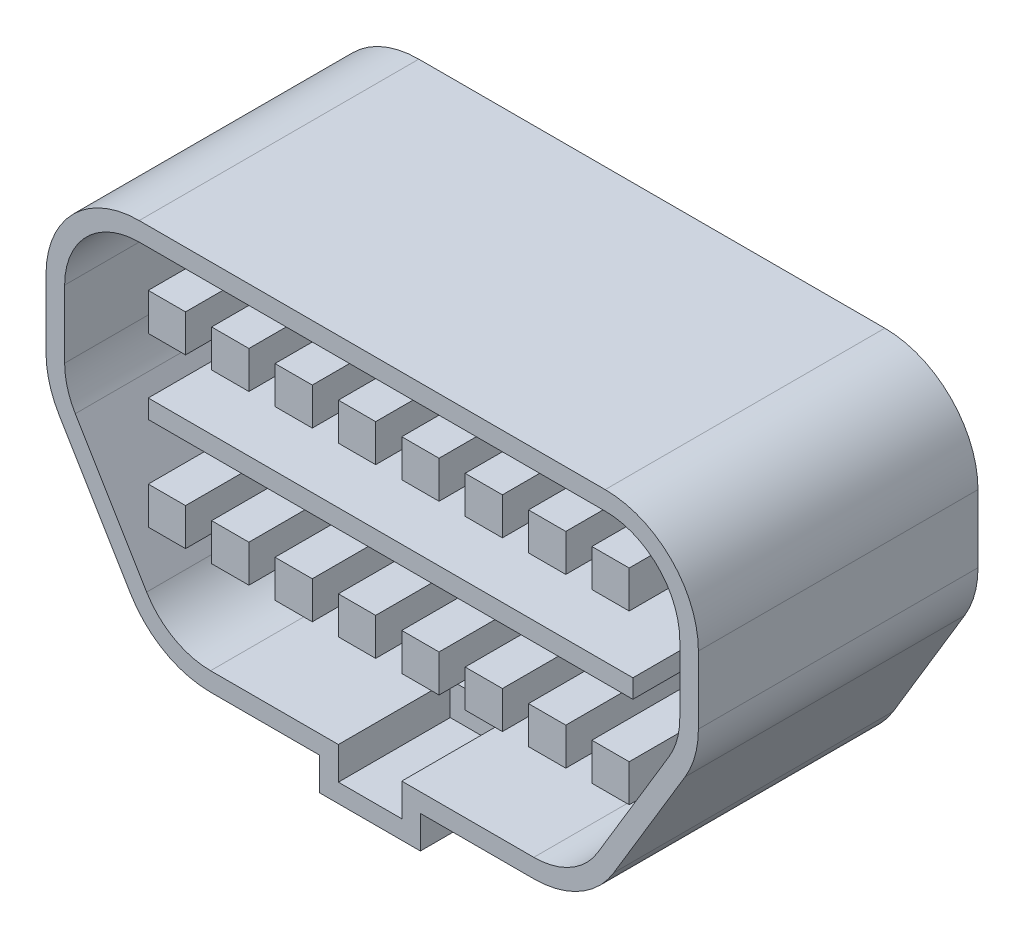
from build123d import *

# Parameters (mm, degrees)
SKETCH1_W           = 35
SKETCH1_H           = 20
BOSS_EXTRUDE1_DEPTH = 15
CHAMFER1_SIZE       = 6
CHAMFER1_SIZE2      = 9.985676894
CHAMFER2_SIZE       = 6
CHAMFER2_SIZE2      = 9.985676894
FILLET1_R           = 5
FILLET2_R           = 5
FILLET3_R           = 5
FILLET4_R           = 5
FILLET5_R           = 5
FILLET6_R           = 5
SHELL2_T            = -1
SKETCH2_W           = 26
SKETCH2_H           = 1
BOSS_EXTRUDE2_DEPTH = 13
SKETCH3_W           = 2
SKETCH3_H           = 2
BOSS_EXTRUDE3_DEPTH = 13
LPATTERN2_COUNT     = 8
LPATTERN2_PITCH     = 3.4
SKETCH4_W           = 2
SKETCH4_H           = 2
BOSS_EXTRUDE4_DEPTH = 13
LPATTERN3_COUNT     = 8
LPATTERN3_PITCH     = 3.4
SKETCH5_W           = 5.4
SKETCH5_H           = 7
BOSS_EXTRUDE5_DEPTH = 1.75
SKETCH6_W           = 3.4
SKETCH6_H           = 6
CUT_EXTRUDE1_DEPTH  = 1.75


with BuildPart() as part:
    # Sketch1 → Boss-Extrude1 (new body)
    with BuildSketch(Plane.XY):
        with Locations((17.5, 10)):
            Rectangle(SKETCH1_W, SKETCH1_H)
    extrude(amount=BOSS_EXTRUDE1_DEPTH)

    # Chamfer1
    chamfer1_edges = [part.edges().sort_by_distance(p)[0] for p in [
        (0, 0, 7.5),
    ]]
    chamfer1_side = [part.faces().sort_by_distance(p)[0] for p in [
        (17.5, 0, 7.5),
    ]]
    chamfer(chamfer1_edges, length=CHAMFER1_SIZE, length2=CHAMFER1_SIZE2, reference=chamfer1_side[0])

    # Chamfer2
    chamfer2_edges = [part.edges().sort_by_distance(p)[0] for p in [
        (35, 0, 7.5),
    ]]
    chamfer2_side = [part.faces().sort_by_distance(p)[0] for p in [
        (20.5, 0, 7.5),
    ]]
    chamfer(chamfer2_edges, length=CHAMFER2_SIZE, length2=CHAMFER2_SIZE2, reference=chamfer2_side[0])

    # Fillet1
    fillet1_edges = [part.edges().sort_by_distance(p)[0] for p in [
        (0, 9.985676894, 7.5),
    ]]
    fillet(fillet1_edges, radius=FILLET1_R)

    # Fillet2
    fillet2_edges = [part.edges().sort_by_distance(p)[0] for p in [
        (35, 9.985676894, 7.5),
    ]]
    fillet(fillet2_edges, radius=FILLET2_R)

    # Fillet3
    fillet3_edges = [part.edges().sort_by_distance(p)[0] for p in [
        (6, 0, 7.5),
    ]]
    fillet(fillet3_edges, radius=FILLET3_R)

    # Fillet4
    fillet4_edges = [part.edges().sort_by_distance(p)[0] for p in [
        (29, 0, 7.5),
    ]]
    fillet(fillet4_edges, radius=FILLET4_R)

    # Fillet5
    fillet5_edges = [part.edges().sort_by_distance(p)[0] for p in [
        (0, 20, 7.5),
    ]]
    fillet(fillet5_edges, radius=FILLET5_R)

    # Fillet6
    fillet6_edges = [part.edges().sort_by_distance(p)[0] for p in [
        (35, 20, 7.5),
    ]]
    fillet(fillet6_edges, radius=FILLET6_R)

    # Shell2
    shell2_openings = [part.faces().sort_by_distance(p)[0] for p in [
        (17.5, 10.524437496, 15),
    ]]
    offset(amount=SHELL2_T, openings=shell2_openings, kind=Kind.INTERSECTION)

    # Sketch2 → Boss-Extrude2 (add)
    with BuildSketch(Plane.XY.offset(1)):
        with Locations((17.485762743, 10.5)):
            Rectangle(SKETCH2_W, SKETCH2_H)
    extrude(amount=BOSS_EXTRUDE2_DEPTH)

    # Sketch3 → Boss-Extrude3 (add)
    with BuildSketch(Plane.XY.offset(1)):
        with Locations((5.485762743, 15)):
            Rectangle(SKETCH3_W, SKETCH3_H)
    boss_extrude3 = extrude(amount=BOSS_EXTRUDE3_DEPTH)

    # LPattern2: Boss-Extrude3 ×8
    with Locations(*[(i * LPATTERN2_PITCH, 0, 0) for i in range(1, LPATTERN2_COUNT)]):
        add(boss_extrude3)

    # Sketch4 → Boss-Extrude4 (add)
    with BuildSketch(Plane.XY.offset(1)):
        with Locations((5.485762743, 6)):
            Rectangle(SKETCH4_W, SKETCH4_H)
    boss_extrude4 = extrude(amount=BOSS_EXTRUDE4_DEPTH)

    # LPattern3: Boss-Extrude4 ×8
    with Locations(*[(i * LPATTERN3_PITCH, 0, 0) for i in range(1, LPATTERN3_COUNT)]):
        add(boss_extrude4)

    # Sketch5 → Boss-Extrude5 (add)
    with BuildSketch(Plane.XZ):
        with Locations((17.385762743, 11.5)):
            Rectangle(SKETCH5_W, SKETCH5_H)
    extrude(amount=BOSS_EXTRUDE5_DEPTH)

    # Sketch6 → Cut-Extrude1 (cut)
    with BuildSketch(Plane(origin=(0, 1, 0), x_dir=(1, 0, 0), z_dir=(0, 1, 0))):
        with Locations((17.385762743, -12)):
            Rectangle(SKETCH6_W, SKETCH6_H)
    extrude(amount=-CUT_EXTRUDE1_DEPTH, mode=Mode.SUBTRACT)


solid = part.part
